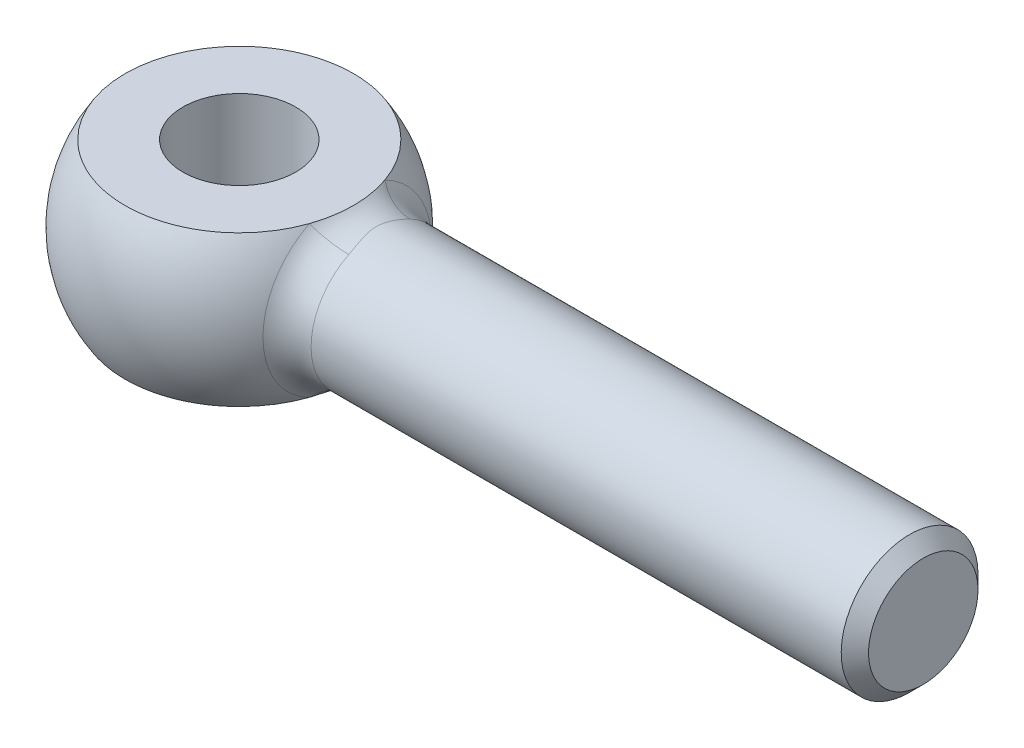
ISO-10303-21;
HEADER;
FILE_DESCRIPTION(('STEP AP214'),'2;1');
FILE_NAME('part.step','',(''),(''),'','','');
FILE_SCHEMA(('AUTOMOTIVE_DESIGN { 1 0 10303 214 1 1 1 1 }'));
ENDSEC;
DATA;
#1=APPLICATION_CONTEXT('core data for automotive mechanical design processes');
#2=APPLICATION_PROTOCOL_DEFINITION('international standard','automotive_design',2000,#1);
#3=PRODUCT_CONTEXT('',#1,'mechanical');
#4=PRODUCT('Part','Part','',(#3));
#5=PRODUCT_RELATED_PRODUCT_CATEGORY('part','',(#4));
#6=PRODUCT_DEFINITION_FORMATION('','',#4);
#7=PRODUCT_DEFINITION_CONTEXT('part definition',#1,'design');
#8=PRODUCT_DEFINITION('design','',#6,#7);
#9=PRODUCT_DEFINITION_SHAPE('','',#8);
#10=(LENGTH_UNIT() NAMED_UNIT(*) SI_UNIT(.MILLI.,.METRE.));
#11=(NAMED_UNIT(*) PLANE_ANGLE_UNIT() SI_UNIT($,.RADIAN.));
#12=(NAMED_UNIT(*) SI_UNIT($,.STERADIAN.) SOLID_ANGLE_UNIT());
#13=UNCERTAINTY_MEASURE_WITH_UNIT(LENGTH_MEASURE(1.E-05),#10,'distance_accuracy_value','');
#14=(GEOMETRIC_REPRESENTATION_CONTEXT(3) GLOBAL_UNCERTAINTY_ASSIGNED_CONTEXT((#13)) GLOBAL_UNIT_ASSIGNED_CONTEXT((#10,
#11,#12)) REPRESENTATION_CONTEXT('',''));
#15=CARTESIAN_POINT('',(0.,0.,0.));
#16=DIRECTION('',(0.,0.,1.));
#17=DIRECTION('',(1.,0.,0.));
#18=AXIS2_PLACEMENT_3D('',#15,#16,#17);
#19=CARTESIAN_POINT('',(100.,0.,0.));
#20=DIRECTION('',(-1.,0.,0.));
#21=DIRECTION('',(0.,0.,1.));
#22=AXIS2_PLACEMENT_3D('',#19,#20,#21);
#23=CYLINDRICAL_SURFACE('',#22,10.);
#24=CARTESIAN_POINT('',(98.,0.,0.));
#25=DIRECTION('',(1.,0.,0.));
#26=DIRECTION('',(0.,0.,-1.));
#27=AXIS2_PLACEMENT_3D('',#24,#25,#26);
#28=CIRCLE('',#27,10.);
#29=CARTESIAN_POINT('',(98.,0.,-10.));
#30=VERTEX_POINT('',#29);
#31=EDGE_CURVE('E11',#30,#30,#28,.F.);
#32=ORIENTED_EDGE('',*,*,#31,.T.);
#33=EDGE_LOOP('',(#32));
#34=FACE_BOUND('',#33,.T.);
#35=CARTESIAN_POINT('',(14.6198715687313,11.,8.0783262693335));
#36=CARTESIAN_POINT('',(16.1346741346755,8.08765751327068,5.99719775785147));
#37=CARTESIAN_POINT('',(19.8401938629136,7.28375150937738,6.85178545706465));
#38=CARTESIAN_POINT('',(14.6942392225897,11.,7.94371146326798));
#39=CARTESIAN_POINT('',(16.2397825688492,8.11920287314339,5.93544808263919));
#40=CARTESIAN_POINT('',(19.9238227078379,7.39683409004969,6.73162150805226));
#41=CARTESIAN_POINT('',(14.7674864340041,11.,7.80678495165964));
#42=CARTESIAN_POINT('',(16.3423149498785,8.15519367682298,5.86983190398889));
#43=CARTESIAN_POINT('',(19.9985173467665,7.50807818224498,6.60735770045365));
#44=CARTESIAN_POINT('',(14.9116503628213,11.,7.52777858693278));
#45=CARTESIAN_POINT('',(16.5404699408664,8.23492168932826,5.72986071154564));
#46=CARTESIAN_POINT('',(20.1309394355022,7.72578328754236,6.35140245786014));
#47=CARTESIAN_POINT('',(14.982567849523,11.,7.38570046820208));
#48=CARTESIAN_POINT('',(16.6361171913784,8.2785823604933,5.65560014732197));
#49=CARTESIAN_POINT('',(20.1886725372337,7.83224588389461,6.2197135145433));
#50=CARTESIAN_POINT('',(15.1217242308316,11.,7.09641260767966));
#51=CARTESIAN_POINT('',(16.8193360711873,8.372447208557,5.49738600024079));
#52=CARTESIAN_POINT('',(20.2879075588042,8.03890108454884,5.95019585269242));
#53=CARTESIAN_POINT('',(15.1899735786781,11.,6.94922832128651));
#54=CARTESIAN_POINT('',(16.9069775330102,8.42255486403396,5.41357855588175));
#55=CARTESIAN_POINT('',(20.3294800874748,8.13911932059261,5.8123968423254));
#56=CARTESIAN_POINT('',(15.323925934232,11.,6.64863682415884));
#57=CARTESIAN_POINT('',(17.0738797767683,8.52797993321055,5.23504745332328));
#58=CARTESIAN_POINT('',(20.3979224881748,8.332958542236,5.53091179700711));
#59=CARTESIAN_POINT('',(15.389629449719,11.,6.49523086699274));
#60=CARTESIAN_POINT('',(17.1531990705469,8.58324700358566,5.14042645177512));
#61=CARTESIAN_POINT('',(20.4247953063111,8.4265808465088,5.38722694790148));
#62=CARTESIAN_POINT('',(15.5078088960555,11.,6.20709411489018));
#63=CARTESIAN_POINT('',(17.2908288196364,8.68811994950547,4.955755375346));
#64=CARTESIAN_POINT('',(20.4619167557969,8.59200338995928,5.11841729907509));
#65=CARTESIAN_POINT('',(15.5607030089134,11.,6.07336532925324));
#66=CARTESIAN_POINT('',(17.3504312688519,8.73711538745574,4.86761224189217));
#67=CARTESIAN_POINT('',(20.4741536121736,8.66488139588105,4.99405789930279));
#68=CARTESIAN_POINT('',(15.6643118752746,11.,5.8009113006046));
#69=CARTESIAN_POINT('',(17.4631108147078,8.8364756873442,4.68301353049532));
#70=CARTESIAN_POINT('',(20.4901477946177,8.80526889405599,4.74215537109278));
#71=CARTESIAN_POINT('',(15.7150266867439,11.,5.66218619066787));
#72=CARTESIAN_POINT('',(17.5162358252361,8.88683503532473,4.58660687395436));
#73=CARTESIAN_POINT('',(20.4939053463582,8.87277852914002,4.61461232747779));
#74=CARTESIAN_POINT('',(15.8508024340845,11.,5.27448741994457));
#75=CARTESIAN_POINT('',(17.6524759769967,9.02498244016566,4.31134076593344));
#76=CARTESIAN_POINT('',(20.4938948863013,9.05025948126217,4.26097993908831));
#77=CARTESIAN_POINT('',(15.9334171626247,11.,5.02010807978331));
#78=CARTESIAN_POINT('',(17.7293699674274,9.11341689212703,4.12339116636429));
#79=CARTESIAN_POINT('',(20.482471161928,9.15455589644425,4.03201043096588));
#80=CARTESIAN_POINT('',(16.0897301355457,11.,4.49398867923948));
#81=CARTESIAN_POINT('',(17.8631716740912,9.28526060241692,3.72252236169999));
#82=CARTESIAN_POINT('',(20.4426249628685,9.34546364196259,3.56728408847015));
#83=CARTESIAN_POINT('',(16.1634219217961,11.,4.2222362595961));
#84=CARTESIAN_POINT('',(17.9203351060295,9.36879764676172,3.50966167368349));
#85=CARTESIAN_POINT('',(20.4141902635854,9.43206219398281,3.3315224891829));
#86=CARTESIAN_POINT('',(16.2999751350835,11.,3.6598860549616));
#87=CARTESIAN_POINT('',(18.0164117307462,9.52556401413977,3.06031940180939));
#88=CARTESIAN_POINT('',(20.3472388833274,9.58737307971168,2.85403184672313));
#89=CARTESIAN_POINT('',(16.3628056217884,11.,3.36923757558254));
#90=CARTESIAN_POINT('',(18.0555089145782,9.59896836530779,2.82367795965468));
#91=CARTESIAN_POINT('',(20.3086941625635,9.65603459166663,2.6122879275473));
#92=CARTESIAN_POINT('',(16.47487160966,11.,2.76973253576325));
#93=CARTESIAN_POINT('',(18.1181298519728,9.73032738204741,2.33005694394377));
#94=CARTESIAN_POINT('',(20.230040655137,9.77497001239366,2.1243839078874));
#95=CARTESIAN_POINT('',(16.5241065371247,11.,2.46087520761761));
#96=CARTESIAN_POINT('',(18.1418261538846,9.78851479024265,2.07279105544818));
#97=CARTESIAN_POINT('',(20.1899318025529,9.82524314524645,1.87822362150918));
#98=CARTESIAN_POINT('',(16.5869215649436,11.,1.97558099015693));
#99=CARTESIAN_POINT('',(18.1691299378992,9.86272425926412,1.66606653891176));
#100=CARTESIAN_POINT('',(20.1346921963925,9.88798469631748,1.49853407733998));
#101=CARTESIAN_POINT('',(16.606401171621,11.,1.8048683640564));
#102=CARTESIAN_POINT('',(18.1769526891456,9.88572783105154,1.52271728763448));
#103=CARTESIAN_POINT('',(20.1166604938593,9.90713175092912,1.3662459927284));
#104=CARTESIAN_POINT('',(16.6402989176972,11.,1.45962748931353));
#105=CARTESIAN_POINT('',(18.1898667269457,9.92572316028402,1.23236071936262));
#106=CARTESIAN_POINT('',(20.0843097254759,9.94012224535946,1.10083909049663));
#107=CARTESIAN_POINT('',(16.6547176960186,11.,1.28509972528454));
#108=CARTESIAN_POINT('',(18.1949689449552,9.9427428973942,1.08526382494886));
#109=CARTESIAN_POINT('',(20.0699901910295,9.95396635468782,0.967720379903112));
#110=CARTESIAN_POINT('',(16.6781317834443,11.,0.933265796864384));
#111=CARTESIAN_POINT('',(18.2029399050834,9.97034914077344,0.788518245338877));
#112=CARTESIAN_POINT('',(20.0463030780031,9.97630347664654,0.700915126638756));
#113=CARTESIAN_POINT('',(16.6871293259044,11.,0.755960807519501));
#114=CARTESIAN_POINT('',(18.2058159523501,9.98095837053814,0.638767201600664));
#115=CARTESIAN_POINT('',(20.0369334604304,9.98479869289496,0.567228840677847));
#116=CARTESIAN_POINT('',(16.6994587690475,11.,0.399779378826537));
#117=CARTESIAN_POINT('',(18.2096928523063,9.9954824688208,0.337908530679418));
#118=CARTESIAN_POINT('',(20.024007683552,9.99641148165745,0.299512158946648));
#119=CARTESIAN_POINT('',(16.7027907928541,11.,0.220902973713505));
#120=CARTESIAN_POINT('',(18.2106967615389,9.99940850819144,0.186688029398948));
#121=CARTESIAN_POINT('',(20.0204513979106,9.99952917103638,0.165481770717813));
#122=CARTESIAN_POINT('',(16.703689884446,11.,-0.136946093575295));
#123=CARTESIAN_POINT('',(18.2109707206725,10.0004672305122,-0.115727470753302));
#124=CARTESIAN_POINT('',(20.0194964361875,10.0003719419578,-0.102589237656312));
#125=CARTESIAN_POINT('',(16.7012576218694,11.,-0.315918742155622));
#126=CARTESIAN_POINT('',(18.2102411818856,9.99760151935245,-0.267039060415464));
#127=CARTESIAN_POINT('',(20.0220970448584,9.99809764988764,-0.236629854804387));
#128=CARTESIAN_POINT('',(16.6907025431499,11.,-0.672512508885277));
#129=CARTESIAN_POINT('',(18.2069499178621,9.98516890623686,-0.56828687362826));
#130=CARTESIAN_POINT('',(20.0332017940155,9.9881689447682,-0.504415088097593));
#131=CARTESIAN_POINT('',(16.6825796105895,11.,-0.85013359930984));
#132=CARTESIAN_POINT('',(18.2043856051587,9.97559239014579,-0.718336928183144));
#133=CARTESIAN_POINT('',(20.0417060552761,9.98051442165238,-0.638159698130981));
#134=CARTESIAN_POINT('',(16.6608685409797,11.,-1.20278271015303));
#135=CARTESIAN_POINT('',(18.1971047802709,9.94999783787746,-1.01586252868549));
#136=CARTESIAN_POINT('',(20.0638261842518,9.95985376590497,-0.905121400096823));
#137=CARTESIAN_POINT('',(16.6472781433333,11.,-1.37780962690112));
#138=CARTESIAN_POINT('',(18.1923815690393,9.93395835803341,-1.16344226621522));
#139=CARTESIAN_POINT('',(20.0774441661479,9.94684541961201,-1.0383382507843));
#140=CARTESIAN_POINT('',(16.6149773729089,11.,-1.72418295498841));
#141=CARTESIAN_POINT('',(18.180309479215,9.89585032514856,-1.45491369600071));
#142=CARTESIAN_POINT('',(20.108600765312,9.9155206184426,-1.30397158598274));
#143=CARTESIAN_POINT('',(16.5962663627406,11.,-1.89552890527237));
#144=CARTESIAN_POINT('',(18.1729504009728,9.87375477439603,-1.59889727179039));
#145=CARTESIAN_POINT('',(20.1261398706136,9.89720350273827,-1.4363879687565));
#146=CARTESIAN_POINT('',(16.5365375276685,11.,-2.37500914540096));
#147=CARTESIAN_POINT('',(18.1475318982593,9.80319058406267,-2.00106702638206));
#148=CARTESIAN_POINT('',(20.1794292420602,9.83780774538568,-1.81042123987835));
#149=CARTESIAN_POINT('',(16.4899385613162,11.,-2.67790730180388));
#150=CARTESIAN_POINT('',(18.1256509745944,9.74810406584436,-2.25372442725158));
#151=CARTESIAN_POINT('',(20.2181580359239,9.79049373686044,-2.05090574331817));
#152=CARTESIAN_POINT('',(16.3835279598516,11.,-3.26643444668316));
#153=CARTESIAN_POINT('',(18.0677502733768,9.62321822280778,-2.73944424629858));
#154=CARTESIAN_POINT('',(20.2950790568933,9.67835774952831,-2.52772088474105));
#155=CARTESIAN_POINT('',(16.3237186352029,11.,-3.55206644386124));
#156=CARTESIAN_POINT('',(18.0315791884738,9.5532044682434,-2.97279590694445));
#157=CARTESIAN_POINT('',(20.3332713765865,9.61353883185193,-2.76405224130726));
#158=CARTESIAN_POINT('',(16.1934500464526,11.,-4.10520079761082));
#159=CARTESIAN_POINT('',(17.9425152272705,9.40307308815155,-3.41694854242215));
#160=CARTESIAN_POINT('',(20.4009956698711,9.46676566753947,-3.2311108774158));
#161=CARTESIAN_POINT('',(16.1230221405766,11.,-4.3727532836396));
#162=CARTESIAN_POINT('',(17.8894603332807,9.32279049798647,-3.62792393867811));
#163=CARTESIAN_POINT('',(20.4305524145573,9.38486161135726,-3.46185240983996));
#164=CARTESIAN_POINT('',(15.9733573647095,11.,-4.89128593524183));
#165=CARTESIAN_POINT('',(17.7649594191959,9.15681833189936,-4.02651224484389));
#166=CARTESIAN_POINT('',(20.4744658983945,9.20410009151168,-3.91720598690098));
#167=CARTESIAN_POINT('',(15.8941219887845,11.,-5.14226890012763));
#168=CARTESIAN_POINT('',(17.6932699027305,9.07099592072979,-4.21407941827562));
#169=CARTESIAN_POINT('',(20.4888252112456,9.10524550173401,-4.14181906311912));
#170=CARTESIAN_POINT('',(15.7452016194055,11.,-5.57948076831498));
#171=CARTESIAN_POINT('',(17.5476124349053,8.91675575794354,-4.52930004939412));
#172=CARTESIAN_POINT('',(20.4959451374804,8.91288683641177,-4.53858237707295));
#173=CARTESIAN_POINT('',(15.6768309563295,11.,-5.76853191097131));
#174=CARTESIAN_POINT('',(17.4767712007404,8.84816828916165,-4.66157604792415));
#175=CARTESIAN_POINT('',(20.4924900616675,8.82235160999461,-4.71214727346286));
#176=CARTESIAN_POINT('',(15.5361317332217,11.,-6.13738931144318));
#177=CARTESIAN_POINT('',(17.3233243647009,8.7136006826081,-4.91098552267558));
#178=CARTESIAN_POINT('',(20.4699143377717,8.63145758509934,-5.05332990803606));
#179=CARTESIAN_POINT('',(15.4638045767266,11.,-6.31719880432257));
#180=CARTESIAN_POINT('',(17.2406040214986,8.64763428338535,-5.02800230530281));
#181=CARTESIAN_POINT('',(20.4507992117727,8.5311022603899,-5.22094972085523));
#182=CARTESIAN_POINT('',(15.3147992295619,11.,-6.67039350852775));
#183=CARTESIAN_POINT('',(17.0629563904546,8.52017906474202,-5.24885941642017));
#184=CARTESIAN_POINT('',(20.3943977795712,8.32005997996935,-5.55115938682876));
#185=CARTESIAN_POINT('',(15.2380797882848,11.,-6.84367796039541));
#186=CARTESIAN_POINT('',(16.9678049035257,8.45881409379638,-5.35236860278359));
#187=CARTESIAN_POINT('',(20.3568998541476,8.20926514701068,-5.71366661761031));
#188=CARTESIAN_POINT('',(15.0813064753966,11.,-7.18254092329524));
#189=CARTESIAN_POINT('',(16.7669351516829,8.34361214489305,-5.54600465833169));
#190=CARTESIAN_POINT('',(20.2617246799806,7.97938823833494,-6.03058739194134));
#191=CARTESIAN_POINT('',(15.0012486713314,11.,-7.34810983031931));
#192=CARTESIAN_POINT('',(16.6611306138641,8.28987110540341,-5.63596246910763));
#193=CARTESIAN_POINT('',(20.2040230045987,7.86029627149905,-6.18499087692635));
#194=CARTESIAN_POINT('',(14.9197282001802,11.,-7.51010721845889));
#195=CARTESIAN_POINT('',(16.5511784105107,8.24137694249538,-5.71943183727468));
#196=CARTESIAN_POINT('',(20.1353038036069,7.73770382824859,-6.33466174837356));
#197=(BOUNDED_SURFACE() B_SPLINE_SURFACE(3,2,((#35,#36,#37),(#38,#39,#40),(#41,#42,#43),(#44,
#45,#46),(#47,#48,#49),(#50,#51,#52),(#53,#54,#55),(#56,#57,#58),(#59,#60,#61),(#62,#63,#64),
(#65,#66,#67),(#68,#69,#70),(#71,#72,#73),(#74,#75,#76),(#77,#78,#79),(#80,#81,#82),(#83,#84,
#85),(#86,#87,#88),(#89,#90,#91),(#92,#93,#94),(#95,#96,#97),(#98,#99,#100),(#101,#102,#103),
(#104,#105,#106),(#107,#108,#109),(#110,#111,#112),(#113,#114,#115),(#116,#117,#118),(#119,#120,
#121),(#122,#123,#124),(#125,#126,#127),(#128,#129,#130),(#131,#132,#133),(#134,#135,#136),
(#137,#138,#139),(#140,#141,#142),(#143,#144,#145),(#146,#147,#148),(#149,#150,#151),(#152,#153,
#154),(#155,#156,#157),(#158,#159,#160),(#161,#162,#163),(#164,#165,#166),(#167,#168,#169),
(#170,#171,#172),(#173,#174,#175),(#176,#177,#178),(#179,#180,#181),(#182,#183,#184),(#185,#186,
#187),(#188,#189,#190),(#191,#192,#193),(#194,#195,#196)),.UNSPECIFIED.,.F.,.F.,
.F.) B_SPLINE_SURFACE_WITH_KNOTS((4,2,2,2,2,2,2,2,2,2,2,2,2,2,2,2,2,2,2,2,2,2,2,2,2,2,4),(3,3),
(0.,0.830487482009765,1.66069791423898,2.48723908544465,3.31361454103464,4.00607990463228,
4.69852683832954,5.90492644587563,7.11219405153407,8.32284604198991,9.53354911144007,
10.1772580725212,10.8208857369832,11.4642480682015,12.1075964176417,12.7508700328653,
13.3941568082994,14.0377098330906,14.6813430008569,15.8623569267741,17.0431644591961,
18.2205508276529,19.3977377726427,20.336589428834,21.2751101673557,22.224698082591,
23.1754380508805),(0.,1.),
.UNSPECIFIED.) GEOMETRIC_REPRESENTATION_ITEM() RATIONAL_B_SPLINE_SURFACE(((1.,0.83928429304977,
1.),(1.,0.842507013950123,1.),(1.,0.845813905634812,1.),(1.,0.852563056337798,1.),(1.,
0.856005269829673,1.),(1.,0.862978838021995,1.),(1.,0.866509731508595,1.),(1.,0.873627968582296,
1.),(1.,0.87721530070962,1.),(1.,0.883811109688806,1.),(1.,0.886819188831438,1.),(1.,
0.892802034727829,1.),(1.,0.895776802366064,1.),(1.,0.903839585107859,1.),(1.,0.908857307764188,
1.),(1.,0.918479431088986,1.),(1.,0.923083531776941,1.),(1.,0.931678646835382,1.),(1.,
0.935667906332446,1.),(1.,0.942805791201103,1.),(1.,0.945954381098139,1.),(1.,0.949974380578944,
1.),(1.,0.95122168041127,1.),(1.,0.953392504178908,1.),(1.,0.954316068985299,1.),(1.,
0.955815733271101,1.),(1.,0.956391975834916,1.),(1.,0.957181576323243,1.),(1.,0.957394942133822,
1.),(1.,0.957452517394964,1.),(1.,0.9572967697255,1.),(1.,0.956620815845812,1.),(1.,
0.956100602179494,1.),(1.,0.95471003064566,1.),(1.,0.953839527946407,1.),(1.,0.951770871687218,
1.),(1.,0.95057267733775,1.),(1.,0.946749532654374,1.),(1.,0.943768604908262,1.),(1.,
0.93698555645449,1.),(1.,0.933183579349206,1.),(1.,0.92496679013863,1.),(1.,0.920553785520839,
1.),(1.,0.911300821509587,1.),(1.,0.906460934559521,1.),(1.,0.897549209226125,1.),(1.,
0.893520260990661,1.),(1.,0.885405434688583,1.),(1.,0.881319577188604,1.),(1.,0.873128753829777,
1.),(1.,0.869024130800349,1.),(1.,0.860913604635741,1.),(1.,0.85690782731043,1.),(1.,
0.852991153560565,1.))) REPRESENTATION_ITEM('') SURFACE());
#198=CARTESIAN_POINT('',(20.1353038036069,7.73770382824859,-6.33466174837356));
#199=CARTESIAN_POINT('',(20.2040230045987,7.86029627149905,-6.18499087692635));
#200=CARTESIAN_POINT('',(20.2617246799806,7.97938823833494,-6.03058739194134));
#201=CARTESIAN_POINT('',(20.3568998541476,8.20926514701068,-5.71366661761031));
#202=CARTESIAN_POINT('',(20.3943977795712,8.32005997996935,-5.55115938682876));
#203=CARTESIAN_POINT('',(20.4507992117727,8.5311022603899,-5.22094972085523));
#204=CARTESIAN_POINT('',(20.4699143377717,8.63145758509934,-5.05332990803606));
#205=CARTESIAN_POINT('',(20.4924900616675,8.82235160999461,-4.71214727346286));
#206=CARTESIAN_POINT('',(20.4959451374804,8.91288683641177,-4.53858237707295));
#207=CARTESIAN_POINT('',(20.4888252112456,9.10524550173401,-4.14181906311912));
#208=CARTESIAN_POINT('',(20.4744658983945,9.20410009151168,-3.91720598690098));
#209=CARTESIAN_POINT('',(20.4305524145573,9.38486161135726,-3.46185240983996));
#210=CARTESIAN_POINT('',(20.4009956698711,9.46676566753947,-3.2311108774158));
#211=CARTESIAN_POINT('',(20.3332713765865,9.61353883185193,-2.76405224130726));
#212=CARTESIAN_POINT('',(20.2950790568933,9.67835774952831,-2.52772088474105));
#213=CARTESIAN_POINT('',(20.2181580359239,9.79049373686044,-2.05090574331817));
#214=CARTESIAN_POINT('',(20.1794292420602,9.83780774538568,-1.81042123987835));
#215=CARTESIAN_POINT('',(20.1261398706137,9.89720350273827,-1.4363879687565));
#216=CARTESIAN_POINT('',(20.108600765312,9.9155206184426,-1.30397158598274));
#217=CARTESIAN_POINT('',(20.0774441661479,9.94684541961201,-1.0383382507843));
#218=CARTESIAN_POINT('',(20.0638261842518,9.95985376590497,-0.905121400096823));
#219=CARTESIAN_POINT('',(20.0417060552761,9.98051442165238,-0.638159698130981));
#220=CARTESIAN_POINT('',(20.0332017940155,9.9881689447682,-0.504415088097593));
#221=CARTESIAN_POINT('',(20.0220970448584,9.99809764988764,-0.236629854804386));
#222=CARTESIAN_POINT('',(20.0194964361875,10.0003719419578,-0.102589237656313));
#223=CARTESIAN_POINT('',(20.0204513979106,9.99952917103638,0.165481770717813));
#224=CARTESIAN_POINT('',(20.024007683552,9.99641148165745,0.299512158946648));
#225=CARTESIAN_POINT('',(20.0369334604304,9.98479869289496,0.567228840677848));
#226=CARTESIAN_POINT('',(20.0463030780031,9.97630347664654,0.700915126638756));
#227=CARTESIAN_POINT('',(20.0699901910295,9.95396635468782,0.967720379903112));
#228=CARTESIAN_POINT('',(20.0843097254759,9.94012224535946,1.10083909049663));
#229=CARTESIAN_POINT('',(20.1166604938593,9.90713175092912,1.3662459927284));
#230=CARTESIAN_POINT('',(20.1346921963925,9.88798469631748,1.49853407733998));
#231=CARTESIAN_POINT('',(20.1899318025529,9.82524314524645,1.87822362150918));
#232=CARTESIAN_POINT('',(20.230040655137,9.77497001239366,2.1243839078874));
#233=CARTESIAN_POINT('',(20.3086941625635,9.65603459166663,2.6122879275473));
#234=CARTESIAN_POINT('',(20.3472388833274,9.58737307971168,2.85403184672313));
#235=CARTESIAN_POINT('',(20.4141902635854,9.43206219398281,3.3315224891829));
#236=CARTESIAN_POINT('',(20.4426249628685,9.34546364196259,3.56728408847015));
#237=CARTESIAN_POINT('',(20.482471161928,9.15455589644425,4.03201043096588));
#238=CARTESIAN_POINT('',(20.4938948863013,9.05025948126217,4.26097993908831));
#239=CARTESIAN_POINT('',(20.4939053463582,8.87277852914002,4.61461232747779));
#240=CARTESIAN_POINT('',(20.4901477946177,8.80526889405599,4.74215537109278));
#241=CARTESIAN_POINT('',(20.4741536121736,8.66488139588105,4.99405789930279));
#242=CARTESIAN_POINT('',(20.4619167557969,8.59200338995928,5.11841729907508));
#243=CARTESIAN_POINT('',(20.4247953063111,8.42658084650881,5.38722694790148));
#244=CARTESIAN_POINT('',(20.3979224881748,8.332958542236,5.53091179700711));
#245=CARTESIAN_POINT('',(20.3294800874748,8.13911932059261,5.8123968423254));
#246=CARTESIAN_POINT('',(20.2879075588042,8.03890108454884,5.95019585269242));
#247=CARTESIAN_POINT('',(20.1886725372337,7.83224588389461,6.2197135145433));
#248=CARTESIAN_POINT('',(20.1309394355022,7.72578328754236,6.35140245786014));
#249=CARTESIAN_POINT('',(19.9985173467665,7.50807818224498,6.60735770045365));
#250=CARTESIAN_POINT('',(19.9238227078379,7.39683409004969,6.73162150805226));
#251=CARTESIAN_POINT('',(19.8401938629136,7.28375150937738,6.85178545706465));
#252=B_SPLINE_CURVE_WITH_KNOTS('',3,(#198,#199,#200,#201,#202,#203,#204,#205,#206,#207,#208,
#209,#210,#211,#212,#213,#214,#215,#216,#217,#218,#219,#220,#221,#222,#223,#224,#225,#226,#227,
#228,#229,#230,#231,#232,#233,#234,#235,#236,#237,#238,#239,#240,#241,#242,#243,#244,#245,#246,
#247,#248,#249,#250,#251),.UNSPECIFIED.,.F.,.F.,(4,2,2,2,2,2,2,2,2,2,2,2,2,2,2,2,2,2,2,2,2,2,2,
2,2,2,4),(0.,0.950739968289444,1.90032788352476,2.83884862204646,3.77770027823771,
4.95488722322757,6.13227359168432,7.3130811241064,8.49409505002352,9.1377282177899,
9.78128124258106,10.4245680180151,11.0678416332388,11.711189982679,12.3545523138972,
12.9981799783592,13.6418889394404,14.8525920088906,16.0632439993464,17.2705116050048,
18.4769112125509,19.1693581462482,19.8618235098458,20.6881989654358,21.5147401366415,
22.3449505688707,23.1754380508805),.UNSPECIFIED.);
#253=CARTESIAN_POINT('',(20.4939015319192,8.9375,-4.48565421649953));
#254=VERTEX_POINT('',#253);
#255=CARTESIAN_POINT('',(20.4939015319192,8.9375,4.48565421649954));
#256=VERTEX_POINT('',#255);
#257=EDGE_CURVE('E94',#254,#256,#252,.T.);
#258=ORIENTED_EDGE('',*,*,#257,.T.);
#259=CARTESIAN_POINT('',(20.4939015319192,0.,0.));
#260=DIRECTION('',(-1.,0.,0.));
#261=DIRECTION('',(0.,0.,1.));
#262=AXIS2_PLACEMENT_3D('',#259,#260,#261);
#263=CIRCLE('',#262,10.);
#264=CARTESIAN_POINT('',(20.4939015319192,-8.9375,4.48565421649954));
#265=VERTEX_POINT('',#264);
#266=EDGE_CURVE('E58',#256,#265,#263,.F.);
#267=ORIENTED_EDGE('',*,*,#266,.T.);
#268=CARTESIAN_POINT('',(14.6198716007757,-11.,-8.07832621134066));
#269=CARTESIAN_POINT('',(16.1346741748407,-8.0876575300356,-5.99719774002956));
#270=CARTESIAN_POINT('',(19.8401938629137,-7.28375150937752,-6.85178545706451));
#271=CARTESIAN_POINT('',(14.6942392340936,-11.,-7.94371144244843));
#272=CARTESIAN_POINT('',(16.2397825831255,-8.11920287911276,-5.93544807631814));
#273=CARTESIAN_POINT('',(19.9238227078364,-7.39683409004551,-6.73162150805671));
#274=CARTESIAN_POINT('',(14.7674864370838,-11.,-7.80678494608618));
#275=CARTESIAN_POINT('',(16.3423149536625,-8.15519367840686,-5.86983190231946));
#276=CARTESIAN_POINT('',(19.9985173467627,-7.50807818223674,-6.60735770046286));
#277=CARTESIAN_POINT('',(14.9116503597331,-11.,-7.527778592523));
#278=CARTESIAN_POINT('',(16.5404699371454,-8.2349216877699,-5.72986071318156));
#279=CARTESIAN_POINT('',(20.1309394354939,-7.72578328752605,-6.3514024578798));
#280=CARTESIAN_POINT('',(14.9825678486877,-11.,-7.38570046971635));
#281=CARTESIAN_POINT('',(16.6361171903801,-8.2785823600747,-5.65560014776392));
#282=CARTESIAN_POINT('',(20.1886725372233,-7.8322458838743,-6.21971351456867));
#283=CARTESIAN_POINT('',(15.1217242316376,-11.,-7.09641260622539));
#284=CARTESIAN_POINT('',(16.8193360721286,-8.37244720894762,-5.49738599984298));
#285=CARTESIAN_POINT('',(20.2879075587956,-8.03890108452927,-5.95019585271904));
#286=CARTESIAN_POINT('',(15.1899735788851,-11.,-6.94922832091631));
#287=CARTESIAN_POINT('',(16.906977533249,-8.42255486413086,-5.41357855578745));
#288=CARTESIAN_POINT('',(20.3294800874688,-8.13911932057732,-5.81239684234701));
#289=CARTESIAN_POINT('',(15.3239259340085,-11.,-6.64863682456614));
#290=CARTESIAN_POINT('',(17.0738797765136,-8.52797993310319,-5.23504745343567));
#291=CARTESIAN_POINT('',(20.3979224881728,-8.33295854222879,-5.53091179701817));
#292=CARTESIAN_POINT('',(15.3896294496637,-11.,-6.49523086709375));
#293=CARTESIAN_POINT('',(17.1531990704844,-8.58324700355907,-5.14042645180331));
#294=CARTESIAN_POINT('',(20.4247953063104,-8.4265808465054,-5.38722694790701));
#295=CARTESIAN_POINT('',(15.5078088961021,-11.,-6.20709411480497));
#296=CARTESIAN_POINT('',(17.290828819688,-8.68811994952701,-4.95575537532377));
#297=CARTESIAN_POINT('',(20.4619167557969,-8.59200338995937,-5.11841729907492));
#298=CARTESIAN_POINT('',(15.5607030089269,-11.,-6.07336532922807));
#299=CARTESIAN_POINT('',(17.3504312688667,-8.73711538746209,-4.8676122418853));
#300=CARTESIAN_POINT('',(20.4741536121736,-8.66488139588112,-4.99405789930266));
#301=CARTESIAN_POINT('',(15.664311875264,-11.,-5.8009113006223));
#302=CARTESIAN_POINT('',(17.4631108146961,-8.83647568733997,-4.6830135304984));
#303=CARTESIAN_POINT('',(20.4901477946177,-8.80526889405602,-4.74215537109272));
#304=CARTESIAN_POINT('',(15.7150266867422,-11.,-5.6621861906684));
#305=CARTESIAN_POINT('',(17.5162358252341,-8.88683503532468,-4.58660687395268));
#306=CARTESIAN_POINT('',(20.4939053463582,-8.87277852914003,-4.61461232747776));
#307=CARTESIAN_POINT('',(15.8508024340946,-11.,-5.2744874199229));
#308=CARTESIAN_POINT('',(17.6524759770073,-9.02498244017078,-4.31134076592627));
#309=CARTESIAN_POINT('',(20.4938948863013,-9.05025948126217,-4.26097993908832));
#310=CARTESIAN_POINT('',(15.9334171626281,-11.,-5.02010807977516));
#311=CARTESIAN_POINT('',(17.7293699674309,-9.1134168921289,-4.12339116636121));
#312=CARTESIAN_POINT('',(20.482471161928,-9.15455589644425,-4.03201043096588));
#313=CARTESIAN_POINT('',(16.0897301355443,-11.,-4.49398867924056));
#314=CARTESIAN_POINT('',(17.8631716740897,-9.28526060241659,-3.72252236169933));
#315=CARTESIAN_POINT('',(20.4426249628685,-9.34546364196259,-3.56728408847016));
#316=CARTESIAN_POINT('',(16.1634219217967,-11.,-4.22223625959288));
#317=CARTESIAN_POINT('',(17.9203351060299,-9.36879764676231,-3.50966167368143));
#318=CARTESIAN_POINT('',(20.4141902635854,-9.4320621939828,-3.3315224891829));
#319=CARTESIAN_POINT('',(16.2999751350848,-11.,-3.6598860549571));
#320=CARTESIAN_POINT('',(18.0164117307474,-9.52556401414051,-3.06031940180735));
#321=CARTESIAN_POINT('',(20.3472388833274,-9.58737307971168,-2.85403184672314));
#322=CARTESIAN_POINT('',(16.3628056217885,-11.,-3.36923757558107));
#323=CARTESIAN_POINT('',(18.0555089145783,-9.59896836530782,-2.82367795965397));
#324=CARTESIAN_POINT('',(20.3086941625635,-9.65603459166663,-2.61228792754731));
#325=CARTESIAN_POINT('',(16.4748716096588,-11.,-2.76973253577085));
#326=CARTESIAN_POINT('',(18.1181298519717,-9.73032738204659,-2.33005694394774));
#327=CARTESIAN_POINT('',(20.230040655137,-9.77497001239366,-2.1243839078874));
#328=CARTESIAN_POINT('',(16.5241065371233,-11.,-2.46087520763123));
#329=CARTESIAN_POINT('',(18.1418261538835,-9.78851479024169,-2.07279105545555));
#330=CARTESIAN_POINT('',(20.1899318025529,-9.82524314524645,-1.87822362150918));
#331=CARTESIAN_POINT('',(16.5869215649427,-11.,-1.97558099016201));
#332=CARTESIAN_POINT('',(18.1691299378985,-9.86272425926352,-1.66606653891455));
#333=CARTESIAN_POINT('',(20.1346921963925,-9.88798469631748,-1.49853407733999));
#334=CARTESIAN_POINT('',(16.6064011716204,-11.,-1.80486836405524));
#335=CARTESIAN_POINT('',(18.1769526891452,-9.88572783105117,-1.52271728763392));
#336=CARTESIAN_POINT('',(20.1166604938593,-9.90713175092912,-1.36624599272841));
#337=CARTESIAN_POINT('',(16.6402989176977,-11.,-1.45962748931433));
#338=CARTESIAN_POINT('',(18.1898667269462,-9.92572316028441,-1.232360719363));
#339=CARTESIAN_POINT('',(20.084309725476,-9.94012224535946,-1.10083909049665));
#340=CARTESIAN_POINT('',(16.6547176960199,-11.,-1.28509972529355));
#341=CARTESIAN_POINT('',(18.1949689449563,-9.94274289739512,-1.08526382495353));
#342=CARTESIAN_POINT('',(20.0699901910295,-9.95396635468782,-0.967720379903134));
#343=CARTESIAN_POINT('',(16.678131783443,-11.,-0.933265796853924));
#344=CARTESIAN_POINT('',(18.2029399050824,-9.97034914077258,-0.788518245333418));
#345=CARTESIAN_POINT('',(20.0463030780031,-9.97630347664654,-0.700915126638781));
#346=CARTESIAN_POINT('',(16.6871293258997,-11.,-0.755960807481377));
#347=CARTESIAN_POINT('',(18.2058159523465,-9.98095837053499,-0.638767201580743));
#348=CARTESIAN_POINT('',(20.0369334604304,-9.98479869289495,-0.567228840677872));
#349=CARTESIAN_POINT('',(16.6994587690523,-11.,-0.399779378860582));
#350=CARTESIAN_POINT('',(18.20969285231,-9.99548246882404,-0.337908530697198));
#351=CARTESIAN_POINT('',(20.024007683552,-9.99641148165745,-0.299512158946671));
#352=CARTESIAN_POINT('',(16.7027907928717,-11.,-0.220902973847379));
#353=CARTESIAN_POINT('',(18.2106967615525,-9.99940850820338,-0.186688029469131));
#354=CARTESIAN_POINT('',(20.0204513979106,-9.99952917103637,-0.165481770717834));
#355=CARTESIAN_POINT('',(16.7036898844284,-11.,0.136946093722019));
#356=CARTESIAN_POINT('',(18.2109707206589,-10.0004672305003,0.11572747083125));
#357=CARTESIAN_POINT('',(20.0194964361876,-10.0003719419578,0.102589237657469));
#358=CARTESIAN_POINT('',(16.7012576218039,-11.,0.315918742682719));
#359=CARTESIAN_POINT('',(18.2102411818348,-9.99760151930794,0.267039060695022));
#360=CARTESIAN_POINT('',(20.0220970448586,-9.9980976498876,0.236629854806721));
#361=CARTESIAN_POINT('',(16.6907025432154,-11.,0.672512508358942));
#362=CARTESIAN_POINT('',(18.2069499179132,-9.98516890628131,0.568286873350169));
#363=CARTESIAN_POINT('',(20.0332017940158,-9.98816894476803,0.504415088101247));
#364=CARTESIAN_POINT('',(16.6825796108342,-11.,0.850133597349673));
#365=CARTESIAN_POINT('',(18.2043856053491,-9.97559239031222,0.718336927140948));
#366=CARTESIAN_POINT('',(20.0417060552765,-9.98051442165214,0.63815969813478));
#367=CARTESIAN_POINT('',(16.660868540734,-11.,1.20278271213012));
#368=CARTESIAN_POINT('',(18.1971047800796,-9.94999783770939,1.01586252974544));
#369=CARTESIAN_POINT('',(20.0638261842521,-9.95985376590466,0.905121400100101));
#370=CARTESIAN_POINT('',(16.6472781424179,-11.,1.37780963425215));
#371=CARTESIAN_POINT('',(18.1923815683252,-9.93395835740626,1.16344227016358));
#372=CARTESIAN_POINT('',(20.0774441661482,-9.94684541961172,1.03833825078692));
#373=CARTESIAN_POINT('',(16.6149773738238,-11.,1.72418294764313));
#374=CARTESIAN_POINT('',(18.1803094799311,-9.89585032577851,1.45491369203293));
#375=CARTESIAN_POINT('',(20.1086007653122,-9.91552061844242,1.30397158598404));
#376=CARTESIAN_POINT('',(16.596266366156,-11.,1.89552887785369));
#377=CARTESIAN_POINT('',(18.1729504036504,-9.87375477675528,1.59889725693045));
#378=CARTESIAN_POINT('',(20.1261398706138,-9.89720350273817,1.43638796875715));
#379=CARTESIAN_POINT('',(16.5365375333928,-11.,2.37500909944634));
#380=CARTESIAN_POINT('',(18.1475319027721,-9.80319058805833,2.00106700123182));
#381=CARTESIAN_POINT('',(20.1794292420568,-9.8378077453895,1.81042123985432));
#382=CARTESIAN_POINT('',(16.4899385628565,-11.,2.67790728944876));
#383=CARTESIAN_POINT('',(18.1256509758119,-9.74810406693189,2.25372442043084));
#384=CARTESIAN_POINT('',(20.2181580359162,-9.79049373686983,2.05090574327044));
#385=CARTESIAN_POINT('',(16.3835279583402,-11.,3.26643445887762));
#386=CARTESIAN_POINT('',(18.0677502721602,-9.62321822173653,2.73944425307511));
#387=CARTESIAN_POINT('',(20.2950790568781,-9.6783577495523,2.52772088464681));
#388=CARTESIAN_POINT('',(16.3237186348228,-11.,3.5520664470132));
#389=CARTESIAN_POINT('',(18.0315791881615,-9.55320446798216,2.9727959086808));
#390=CARTESIAN_POINT('',(20.333271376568,-9.61353883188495,2.76405224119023));
#391=CARTESIAN_POINT('',(16.1934500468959,-11.,4.1052007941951));
#392=CARTESIAN_POINT('',(17.942515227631,-9.40307308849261,3.41694854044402));
#393=CARTESIAN_POINT('',(20.4009956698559,-9.46676566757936,3.23111087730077));
#394=CARTESIAN_POINT('',(16.1230221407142,-11.,4.37275328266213));
#395=CARTESIAN_POINT('',(17.8894603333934,-9.3227904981,3.62792393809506));
#396=CARTESIAN_POINT('',(20.4305524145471,-9.38486161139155,3.46185240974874));
#397=CARTESIAN_POINT('',(15.9733573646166,-11.,4.89128593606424));
#398=CARTESIAN_POINT('',(17.7649594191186,-9.15681833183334,4.02651224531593));
#399=CARTESIAN_POINT('',(20.4744658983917,-9.20410009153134,3.9172059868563));
#400=CARTESIAN_POINT('',(15.8941219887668,-11.,5.14226890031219));
#401=CARTESIAN_POINT('',(17.6932699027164,-9.0709959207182,4.21407941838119));
#402=CARTESIAN_POINT('',(20.4888252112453,-9.10524550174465,4.14181906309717));
#403=CARTESIAN_POINT('',(15.7452016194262,-11.,5.5794807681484));
#404=CARTESIAN_POINT('',(17.5476124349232,-8.91675575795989,4.52930004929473));
#405=CARTESIAN_POINT('',(20.4959451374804,-8.91288683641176,4.53858237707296));
#406=CARTESIAN_POINT('',(15.6768309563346,-11.,5.76853191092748));
#407=CARTESIAN_POINT('',(17.4767712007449,-8.84816828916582,4.66157604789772));
#408=CARTESIAN_POINT('',(20.4924900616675,-8.8223516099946,4.71214727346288));
#409=CARTESIAN_POINT('',(15.5361317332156,-11.,6.13738931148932));
#410=CARTESIAN_POINT('',(17.3233243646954,-8.71360068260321,4.91098552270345));
#411=CARTESIAN_POINT('',(20.4699143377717,-8.63145758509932,5.05332990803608));
#412=CARTESIAN_POINT('',(15.4638045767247,-11.,6.31719880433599));
#413=CARTESIAN_POINT('',(17.2406040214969,-8.64763428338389,5.02800230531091));
#414=CARTESIAN_POINT('',(20.4507992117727,-8.53110226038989,5.22094972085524));
#415=CARTESIAN_POINT('',(15.3147992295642,-11.,6.67039350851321));
#416=CARTESIAN_POINT('',(17.0629563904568,-8.52017906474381,5.24885941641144));
#417=CARTESIAN_POINT('',(20.3943977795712,-8.32005997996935,5.55115938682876));
#418=CARTESIAN_POINT('',(15.2380797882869,-11.,6.84367796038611));
#419=CARTESIAN_POINT('',(16.9678049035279,-8.45881409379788,5.35236860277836));
#420=CARTESIAN_POINT('',(20.3568998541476,-8.20926514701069,5.71366661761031));
#421=CARTESIAN_POINT('',(15.0813064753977,-11.,7.18254092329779));
#422=CARTESIAN_POINT('',(16.7669351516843,-8.34361214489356,5.54600465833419));
#423=CARTESIAN_POINT('',(20.2617246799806,-7.97938823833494,6.03058739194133));
#424=CARTESIAN_POINT('',(15.0012486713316,-11.,7.3481098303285));
#425=CARTESIAN_POINT('',(16.6611306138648,-8.28987110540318,5.63596246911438));
#426=CARTESIAN_POINT('',(20.2040230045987,-7.86029627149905,6.18499087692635));
#427=CARTESIAN_POINT('',(14.9197282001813,-11.,7.51010721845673));
#428=CARTESIAN_POINT('',(16.551178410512,-8.24137694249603,5.71943183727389));
#429=CARTESIAN_POINT('',(20.1353038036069,-7.73770382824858,6.33466174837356));
#430=(BOUNDED_SURFACE() B_SPLINE_SURFACE(3,2,((#268,#269,#270),(#271,#272,#273),(#274,#275,
#276),(#277,#278,#279),(#280,#281,#282),(#283,#284,#285),(#286,#287,#288),(#289,#290,#291),
(#292,#293,#294),(#295,#296,#297),(#298,#299,#300),(#301,#302,#303),(#304,#305,#306),(#307,#308,
#309),(#310,#311,#312),(#313,#314,#315),(#316,#317,#318),(#319,#320,#321),(#322,#323,#324),
(#325,#326,#327),(#328,#329,#330),(#331,#332,#333),(#334,#335,#336),(#337,#338,#339),(#340,#341,
#342),(#343,#344,#345),(#346,#347,#348),(#349,#350,#351),(#352,#353,#354),(#355,#356,#357),
(#358,#359,#360),(#361,#362,#363),(#364,#365,#366),(#367,#368,#369),(#370,#371,#372),(#373,#374,
#375),(#376,#377,#378),(#379,#380,#381),(#382,#383,#384),(#385,#386,#387),(#388,#389,#390),
(#391,#392,#393),(#394,#395,#396),(#397,#398,#399),(#400,#401,#402),(#403,#404,#405),(#406,#407,
#408),(#409,#410,#411),(#412,#413,#414),(#415,#416,#417),(#418,#419,#420),(#421,#422,#423),
(#424,#425,#426),(#427,#428,#429)),.UNSPECIFIED.,.F.,.F.,.F.) B_SPLINE_SURFACE_WITH_KNOTS((4,2,
2,2,2,2,2,2,2,2,2,2,2,2,2,2,2,2,2,2,2,2,2,2,2,2,4),(3,3),(0.,0.830487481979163,1.66069791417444,
2.48723908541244,3.31361454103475,4.0060799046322,4.69852683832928,5.90492644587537,
7.11219405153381,8.32284604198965,9.53354911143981,10.177258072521,10.8208857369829,
11.4642480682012,12.1075964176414,12.7508700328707,13.3941568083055,14.0377098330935,
14.6813430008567,15.8623569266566,17.0431644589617,18.2205508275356,19.3977377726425,
20.3365894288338,21.2751101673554,22.2246980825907,23.1754380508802),(0.,1.),
.UNSPECIFIED.) GEOMETRIC_REPRESENTATION_ITEM() RATIONAL_B_SPLINE_SURFACE(((1.,0.839284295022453,
1.),(1.,0.842507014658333,1.),(1.,0.845813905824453,1.),(1.,0.852563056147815,1.),(1.,
0.856005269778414,1.),(1.,0.862978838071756,1.),(1.,0.866509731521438,1.),(1.,0.873627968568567,
1.),(1.,0.87721530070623,1.),(1.,0.88381110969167,1.),(1.,0.886819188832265,1.),(1.,
0.892802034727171,1.),(1.,0.895776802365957,1.),(1.,0.903839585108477,1.),(1.,0.908857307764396,
1.),(1.,0.9184794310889,1.),(1.,0.923083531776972,1.),(1.,0.931678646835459,1.),(1.,
0.935667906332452,1.),(1.,0.942805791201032,1.),(1.,0.945954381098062,1.),(1.,0.949974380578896,
1.),(1.,0.95122168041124,1.),(1.,0.953392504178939,1.),(1.,0.954316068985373,1.),(1.,
0.955815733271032,1.),(1.,0.956391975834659,1.),(1.,0.957181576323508,1.),(1.,0.957394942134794,
1.),(1.,0.957452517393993,1.),(1.,0.957296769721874,1.),(1.,0.956620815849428,1.),(1.,
0.956100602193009,1.),(1.,0.954710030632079,1.),(1.,0.953839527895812,1.),(1.,0.951770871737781,
1.),(1.,0.950572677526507,1.),(1.,0.946749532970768,1.),(1.,0.943768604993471,1.),(1.,
0.936985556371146,1.),(1.,0.933183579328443,1.),(1.,0.924966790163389,1.),(1.,0.920553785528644,
1.),(1.,0.911300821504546,1.),(1.,0.906460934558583,1.),(1.,0.897549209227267,1.),(1.,
0.893520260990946,1.),(1.,0.885405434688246,1.),(1.,0.881319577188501,1.),(1.,0.873128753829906,
1.),(1.,0.86902413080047,1.),(1.,0.86091360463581,1.),(1.,0.856907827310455,1.),(1.,
0.852991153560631,1.))) REPRESENTATION_ITEM('') SURFACE());
#431=CARTESIAN_POINT('',(20.1353038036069,-7.73770382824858,6.33466174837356));
#432=CARTESIAN_POINT('',(20.2040230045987,-7.86029627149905,6.18499087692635));
#433=CARTESIAN_POINT('',(20.2617246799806,-7.97938823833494,6.03058739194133));
#434=CARTESIAN_POINT('',(20.3568998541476,-8.20926514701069,5.71366661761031));
#435=CARTESIAN_POINT('',(20.3943977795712,-8.32005997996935,5.55115938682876));
#436=CARTESIAN_POINT('',(20.4507992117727,-8.53110226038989,5.22094972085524));
#437=CARTESIAN_POINT('',(20.4699143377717,-8.63145758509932,5.05332990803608));
#438=CARTESIAN_POINT('',(20.4924900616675,-8.8223516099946,4.71214727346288));
#439=CARTESIAN_POINT('',(20.4959451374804,-8.91288683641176,4.53858237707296));
#440=CARTESIAN_POINT('',(20.4888252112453,-9.10524550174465,4.14181906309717));
#441=CARTESIAN_POINT('',(20.4744658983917,-9.20410009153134,3.9172059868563));
#442=CARTESIAN_POINT('',(20.4305524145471,-9.38486161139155,3.46185240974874));
#443=CARTESIAN_POINT('',(20.4009956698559,-9.46676566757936,3.23111087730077));
#444=CARTESIAN_POINT('',(20.333271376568,-9.61353883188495,2.76405224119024));
#445=CARTESIAN_POINT('',(20.2950790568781,-9.6783577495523,2.52772088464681));
#446=CARTESIAN_POINT('',(20.2181580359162,-9.79049373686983,2.05090574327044));
#447=CARTESIAN_POINT('',(20.1794292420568,-9.8378077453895,1.81042123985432));
#448=CARTESIAN_POINT('',(20.1261398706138,-9.89720350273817,1.43638796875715));
#449=CARTESIAN_POINT('',(20.1086007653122,-9.91552061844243,1.30397158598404));
#450=CARTESIAN_POINT('',(20.0774441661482,-9.94684541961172,1.03833825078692));
#451=CARTESIAN_POINT('',(20.0638261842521,-9.95985376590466,0.905121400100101));
#452=CARTESIAN_POINT('',(20.0417060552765,-9.98051442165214,0.63815969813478));
#453=CARTESIAN_POINT('',(20.0332017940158,-9.98816894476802,0.504415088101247));
#454=CARTESIAN_POINT('',(20.0220970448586,-9.9980976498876,0.236629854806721));
#455=CARTESIAN_POINT('',(20.0194964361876,-10.0003719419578,0.102589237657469));
#456=CARTESIAN_POINT('',(20.0204513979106,-9.99952917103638,-0.165481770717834));
#457=CARTESIAN_POINT('',(20.024007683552,-9.99641148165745,-0.299512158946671));
#458=CARTESIAN_POINT('',(20.0369334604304,-9.98479869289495,-0.567228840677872));
#459=CARTESIAN_POINT('',(20.0463030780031,-9.97630347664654,-0.700915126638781));
#460=CARTESIAN_POINT('',(20.0699901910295,-9.95396635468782,-0.967720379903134));
#461=CARTESIAN_POINT('',(20.084309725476,-9.94012224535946,-1.10083909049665));
#462=CARTESIAN_POINT('',(20.1166604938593,-9.90713175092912,-1.36624599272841));
#463=CARTESIAN_POINT('',(20.1346921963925,-9.88798469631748,-1.49853407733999));
#464=CARTESIAN_POINT('',(20.1899318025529,-9.82524314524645,-1.87822362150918));
#465=CARTESIAN_POINT('',(20.230040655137,-9.77497001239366,-2.1243839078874));
#466=CARTESIAN_POINT('',(20.3086941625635,-9.65603459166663,-2.61228792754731));
#467=CARTESIAN_POINT('',(20.3472388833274,-9.58737307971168,-2.85403184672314));
#468=CARTESIAN_POINT('',(20.4141902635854,-9.4320621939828,-3.3315224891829));
#469=CARTESIAN_POINT('',(20.4426249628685,-9.34546364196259,-3.56728408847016));
#470=CARTESIAN_POINT('',(20.482471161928,-9.15455589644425,-4.03201043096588));
#471=CARTESIAN_POINT('',(20.4938948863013,-9.05025948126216,-4.26097993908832));
#472=CARTESIAN_POINT('',(20.4939053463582,-8.87277852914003,-4.61461232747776));
#473=CARTESIAN_POINT('',(20.4901477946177,-8.80526889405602,-4.74215537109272));
#474=CARTESIAN_POINT('',(20.4741536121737,-8.66488139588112,-4.99405789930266));
#475=CARTESIAN_POINT('',(20.4619167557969,-8.59200338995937,-5.11841729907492));
#476=CARTESIAN_POINT('',(20.4247953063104,-8.4265808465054,-5.38722694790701));
#477=CARTESIAN_POINT('',(20.3979224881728,-8.33295854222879,-5.53091179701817));
#478=CARTESIAN_POINT('',(20.3294800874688,-8.13911932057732,-5.81239684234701));
#479=CARTESIAN_POINT('',(20.2879075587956,-8.03890108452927,-5.95019585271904));
#480=CARTESIAN_POINT('',(20.1886725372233,-7.8322458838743,-6.21971351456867));
#481=CARTESIAN_POINT('',(20.1309394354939,-7.72578328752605,-6.3514024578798));
#482=CARTESIAN_POINT('',(19.9985173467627,-7.50807818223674,-6.60735770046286));
#483=CARTESIAN_POINT('',(19.9238227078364,-7.39683409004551,-6.73162150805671));
#484=CARTESIAN_POINT('',(19.8401938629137,-7.28375150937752,-6.85178545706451));
#485=B_SPLINE_CURVE_WITH_KNOTS('',3,(#431,#432,#433,#434,#435,#436,#437,#438,#439,#440,#441,
#442,#443,#444,#445,#446,#447,#448,#449,#450,#451,#452,#453,#454,#455,#456,#457,#458,#459,#460,
#461,#462,#463,#464,#465,#466,#467,#468,#469,#470,#471,#472,#473,#474,#475,#476,#477,#478,#479,
#480,#481,#482,#483,#484),.UNSPECIFIED.,.F.,.F.,(4,2,2,2,2,2,2,2,2,2,2,2,2,2,2,2,2,2,2,2,2,2,2,
2,2,2,4),(0.,0.950739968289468,1.90032788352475,2.83884862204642,3.77770027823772,
4.95488722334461,6.13227359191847,7.31308112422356,8.49409505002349,9.13772821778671,
9.78128124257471,10.4245680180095,11.0678416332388,11.711189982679,12.3545523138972,
12.9981799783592,13.6418889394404,14.8525920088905,16.0632439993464,17.2705116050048,
18.4769112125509,19.169358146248,19.8618235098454,20.6881989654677,21.5147401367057,
22.344950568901,23.1754380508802),.UNSPECIFIED.);
#486=CARTESIAN_POINT('',(20.4939015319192,-8.93749999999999,-4.48565421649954));
#487=VERTEX_POINT('',#486);
#488=EDGE_CURVE('E62',#265,#487,#485,.T.);
#489=ORIENTED_EDGE('',*,*,#488,.T.);
#490=CARTESIAN_POINT('',(20.4939015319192,0.,0.));
#491=DIRECTION('',(-1.,0.,0.));
#492=DIRECTION('',(0.,0.,1.));
#493=AXIS2_PLACEMENT_3D('',#490,#491,#492);
#494=CIRCLE('',#493,10.);
#495=EDGE_CURVE('E111',#487,#254,#494,.F.);
#496=ORIENTED_EDGE('',*,*,#495,.T.);
#497=EDGE_LOOP('',(#258,#267,#489,#496));
#498=FACE_BOUND('',#497,.T.);
#499=ADVANCED_FACE('F43',(#34,#498),#23,.T.);
#500=CARTESIAN_POINT('',(100.,0.,0.));
#501=DIRECTION('',(1.,0.,0.));
#502=DIRECTION('',(0.,0.,-1.));
#503=AXIS2_PLACEMENT_3D('',#500,#501,#502);
#504=PLANE('',#503);
#505=CARTESIAN_POINT('',(100.,0.,0.));
#506=DIRECTION('',(1.,0.,0.));
#507=DIRECTION('',(0.,0.,-1.));
#508=AXIS2_PLACEMENT_3D('',#505,#506,#507);
#509=CIRCLE('',#508,7.99999999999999);
#510=CARTESIAN_POINT('',(100.,0.,-7.99999999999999));
#511=VERTEX_POINT('',#510);
#512=EDGE_CURVE('E51',#511,#511,#509,.T.);
#513=ORIENTED_EDGE('',*,*,#512,.T.);
#514=EDGE_LOOP('',(#513));
#515=FACE_BOUND('',#514,.T.);
#516=ADVANCED_FACE('F158',(#515),#504,.T.);
#517=CARTESIAN_POINT('',(0.,0.,0.));
#518=DIRECTION('',(0.,0.,-1.));
#519=DIRECTION('',(1.,0.,0.));
#520=AXIS2_PLACEMENT_3D('',#517,#518,#519);
#521=SPHERICAL_SURFACE('',#520,20.);
#522=CARTESIAN_POINT('',(0.,11.,0.));
#523=DIRECTION('',(0.,-1.,0.));
#524=DIRECTION('',(1.,0.,0.));
#525=AXIS2_PLACEMENT_3D('',#522,#523,#524);
#526=CIRCLE('',#525,16.7032930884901);
#527=CARTESIAN_POINT('',(15.7645396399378,11.,-5.52080518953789));
#528=VERTEX_POINT('',#527);
#529=CARTESIAN_POINT('',(15.7645396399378,11.,5.52080518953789));
#530=VERTEX_POINT('',#529);
#531=EDGE_CURVE('E89',#528,#530,#526,.F.);
#532=ORIENTED_EDGE('',*,*,#531,.F.);
#533=CARTESIAN_POINT('',(15.7645396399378,0.,0.));
#534=DIRECTION('',(-1.,0.,0.));
#535=DIRECTION('',(0.,0.,1.));
#536=AXIS2_PLACEMENT_3D('',#533,#534,#535);
#537=CIRCLE('',#536,12.3076923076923);
#538=CARTESIAN_POINT('',(15.7645396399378,-11.,-5.52080518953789));
#539=VERTEX_POINT('',#538);
#540=EDGE_CURVE('E83',#528,#539,#537,.T.);
#541=ORIENTED_EDGE('',*,*,#540,.T.);
#542=CARTESIAN_POINT('',(0.,-11.,0.));
#543=DIRECTION('',(0.,1.,0.));
#544=DIRECTION('',(-1.,0.,0.));
#545=AXIS2_PLACEMENT_3D('',#542,#543,#544);
#546=CIRCLE('',#545,16.7032930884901);
#547=CARTESIAN_POINT('',(15.7645396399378,-11.,5.52080518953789));
#548=VERTEX_POINT('',#547);
#549=EDGE_CURVE('E86',#548,#539,#546,.F.);
#550=ORIENTED_EDGE('',*,*,#549,.F.);
#551=CARTESIAN_POINT('',(15.7645396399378,0.,0.));
#552=DIRECTION('',(-1.,0.,0.));
#553=DIRECTION('',(0.,0.,1.));
#554=AXIS2_PLACEMENT_3D('',#551,#552,#553);
#555=CIRCLE('',#554,12.3076923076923);
#556=EDGE_CURVE('E95',#548,#530,#555,.T.);
#557=ORIENTED_EDGE('',*,*,#556,.T.);
#558=EDGE_LOOP('',(#532,#541,#550,#557));
#559=FACE_BOUND('',#558,.T.);
#560=ADVANCED_FACE('F85',(#559),#521,.T.);
#561=CARTESIAN_POINT('',(-16.7032930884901,11.,-20.));
#562=DIRECTION('',(0.,-1.,0.));
#563=DIRECTION('',(1.,0.,0.));
#564=AXIS2_PLACEMENT_3D('',#561,#562,#563);
#565=PLANE('',#564);
#566=CARTESIAN_POINT('',(0.,11.,0.));
#567=DIRECTION('',(0.,1.,0.));
#568=DIRECTION('',(0.,0.,1.));
#569=AXIS2_PLACEMENT_3D('',#566,#567,#568);
#570=CIRCLE('',#569,8.25);
#571=CARTESIAN_POINT('',(0.,11.,8.25));
#572=VERTEX_POINT('',#571);
#573=EDGE_CURVE('E114',#572,#572,#570,.T.);
#574=ORIENTED_EDGE('',*,*,#573,.F.);
#575=EDGE_LOOP('',(#574));
#576=FACE_BOUND('',#575,.T.);
#577=ORIENTED_EDGE('',*,*,#531,.T.);
#578=EDGE_CURVE('E186',#530,#528,#526,.F.);
#579=ORIENTED_EDGE('',*,*,#578,.T.);
#580=EDGE_LOOP('',(#577,#579));
#581=FACE_BOUND('',#580,.T.);
#582=ADVANCED_FACE('F152',(#576,#581),#565,.F.);
#583=CARTESIAN_POINT('',(-16.7032930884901,-11.,-20.));
#584=DIRECTION('',(0.,1.,0.));
#585=DIRECTION('',(-1.,0.,0.));
#586=AXIS2_PLACEMENT_3D('',#583,#584,#585);
#587=PLANE('',#586);
#588=CARTESIAN_POINT('',(0.,-11.,0.));
#589=DIRECTION('',(0.,1.,0.));
#590=DIRECTION('',(0.,0.,1.));
#591=AXIS2_PLACEMENT_3D('',#588,#589,#590);
#592=CIRCLE('',#591,8.24999999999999);
#593=CARTESIAN_POINT('',(0.,-11.,8.24999999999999));
#594=VERTEX_POINT('',#593);
#595=EDGE_CURVE('E187',#594,#594,#592,.T.);
#596=ORIENTED_EDGE('',*,*,#595,.T.);
#597=EDGE_LOOP('',(#596));
#598=FACE_BOUND('',#597,.T.);
#599=EDGE_CURVE('E100',#539,#548,#546,.F.);
#600=ORIENTED_EDGE('',*,*,#599,.T.);
#601=ORIENTED_EDGE('',*,*,#549,.T.);
#602=EDGE_LOOP('',(#600,#601));
#603=FACE_BOUND('',#602,.T.);
#604=ADVANCED_FACE('F99',(#598,#603),#587,.F.);
#605=CARTESIAN_POINT('',(0.,11.,0.));
#606=DIRECTION('',(0.,1.,0.));
#607=DIRECTION('',(0.,0.,1.));
#608=AXIS2_PLACEMENT_3D('',#605,#606,#607);
#609=CYLINDRICAL_SURFACE('',#608,8.24999999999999);
#610=ORIENTED_EDGE('',*,*,#595,.F.);
#611=EDGE_LOOP('',(#610));
#612=FACE_BOUND('',#611,.T.);
#613=ORIENTED_EDGE('',*,*,#573,.T.);
#614=EDGE_LOOP('',(#613));
#615=FACE_BOUND('',#614,.T.);
#616=ADVANCED_FACE('F151',(#612,#615),#609,.F.);
#617=CARTESIAN_POINT('',(20.4939015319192,-14.3,-7.17704674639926));
#618=DIRECTION('',(0.,0.448565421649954,-0.893749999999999));
#619=DIRECTION('',(0.,0.893749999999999,0.448565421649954));
#620=AXIS2_PLACEMENT_3D('',#617,#618,#619);
#621=CIRCLE('',#620,6.);
#622=EDGE_CURVE('E105',#487,#539,#621,.F.);
#623=ORIENTED_EDGE('',*,*,#622,.F.);
#624=ORIENTED_EDGE('',*,*,#488,.F.);
#625=CARTESIAN_POINT('',(20.4939015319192,-14.3,7.17704674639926));
#626=DIRECTION('',(0.,-0.448565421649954,-0.89375));
#627=DIRECTION('',(0.,0.89375,-0.448565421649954));
#628=AXIS2_PLACEMENT_3D('',#625,#626,#627);
#629=CIRCLE('',#628,6.);
#630=EDGE_CURVE('E108',#548,#265,#629,.T.);
#631=ORIENTED_EDGE('',*,*,#630,.F.);
#632=ORIENTED_EDGE('',*,*,#599,.F.);
#633=EDGE_LOOP('',(#623,#624,#631,#632));
#634=FACE_BOUND('',#633,.T.);
#635=ADVANCED_FACE('F104',(#634),#430,.F.);
#636=CARTESIAN_POINT('',(20.4939015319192,0.,0.));
#637=DIRECTION('',(-1.,0.,0.));
#638=DIRECTION('',(0.,0.,1.));
#639=AXIS2_PLACEMENT_3D('',#636,#637,#638);
#640=TOROIDAL_SURFACE('',#639,16.,6.);
#641=ORIENTED_EDGE('',*,*,#630,.T.);
#642=ORIENTED_EDGE('',*,*,#266,.F.);
#643=CARTESIAN_POINT('',(20.4939015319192,14.3,7.17704674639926));
#644=DIRECTION('',(0.,-0.448565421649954,0.89375));
#645=DIRECTION('',(0.,-0.89375,-0.448565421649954));
#646=AXIS2_PLACEMENT_3D('',#643,#644,#645);
#647=CIRCLE('',#646,6.);
#648=EDGE_CURVE('E112',#530,#256,#647,.T.);
#649=ORIENTED_EDGE('',*,*,#648,.F.);
#650=ORIENTED_EDGE('',*,*,#556,.F.);
#651=EDGE_LOOP('',(#641,#642,#649,#650));
#652=FACE_BOUND('',#651,.T.);
#653=ADVANCED_FACE('F197',(#652),#640,.F.);
#654=CARTESIAN_POINT('',(20.4939015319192,0.,0.));
#655=DIRECTION('',(-1.,0.,0.));
#656=DIRECTION('',(0.,0.,1.));
#657=AXIS2_PLACEMENT_3D('',#654,#655,#656);
#658=TOROIDAL_SURFACE('',#657,16.,6.);
#659=ORIENTED_EDGE('',*,*,#622,.T.);
#660=ORIENTED_EDGE('',*,*,#540,.F.);
#661=CARTESIAN_POINT('',(20.4939015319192,14.3,-7.17704674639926));
#662=DIRECTION('',(0.,-0.448565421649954,-0.893749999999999));
#663=DIRECTION('',(0.,0.89375,-0.448565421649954));
#664=AXIS2_PLACEMENT_3D('',#661,#662,#663);
#665=CIRCLE('',#664,6.);
#666=EDGE_CURVE('E116',#254,#528,#665,.T.);
#667=ORIENTED_EDGE('',*,*,#666,.F.);
#668=ORIENTED_EDGE('',*,*,#495,.F.);
#669=EDGE_LOOP('',(#659,#660,#667,#668));
#670=FACE_BOUND('',#669,.T.);
#671=ADVANCED_FACE('F110',(#670),#658,.F.);
#672=ORIENTED_EDGE('',*,*,#648,.T.);
#673=ORIENTED_EDGE('',*,*,#257,.F.);
#674=ORIENTED_EDGE('',*,*,#666,.T.);
#675=ORIENTED_EDGE('',*,*,#578,.F.);
#676=EDGE_LOOP('',(#672,#673,#674,#675));
#677=FACE_BOUND('',#676,.T.);
#678=ADVANCED_FACE('F162',(#677),#197,.F.);
#679=CARTESIAN_POINT('',(100.,0.,0.));
#680=DIRECTION('',(-1.,0.,0.));
#681=DIRECTION('',(0.,0.,1.));
#682=AXIS2_PLACEMENT_3D('',#679,#680,#681);
#683=CONICAL_SURFACE('',#682,7.99999999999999,0.785398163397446);
#684=ORIENTED_EDGE('',*,*,#31,.F.);
#685=EDGE_LOOP('',(#684));
#686=FACE_BOUND('',#685,.T.);
#687=ORIENTED_EDGE('',*,*,#512,.F.);
#688=EDGE_LOOP('',(#687));
#689=FACE_BOUND('',#688,.T.);
#690=ADVANCED_FACE('F45',(#686,#689),#683,.T.);
#691=CLOSED_SHELL('',(#499,#516,#560,#582,#604,#616,#635,#653,#671,#678,#690));
#692=MANIFOLD_SOLID_BREP('B2',#691);
#693=ADVANCED_BREP_SHAPE_REPRESENTATION('',(#18,#692),#14);
#694=SHAPE_DEFINITION_REPRESENTATION(#9,#693);
ENDSEC;
END-ISO-10303-21;
